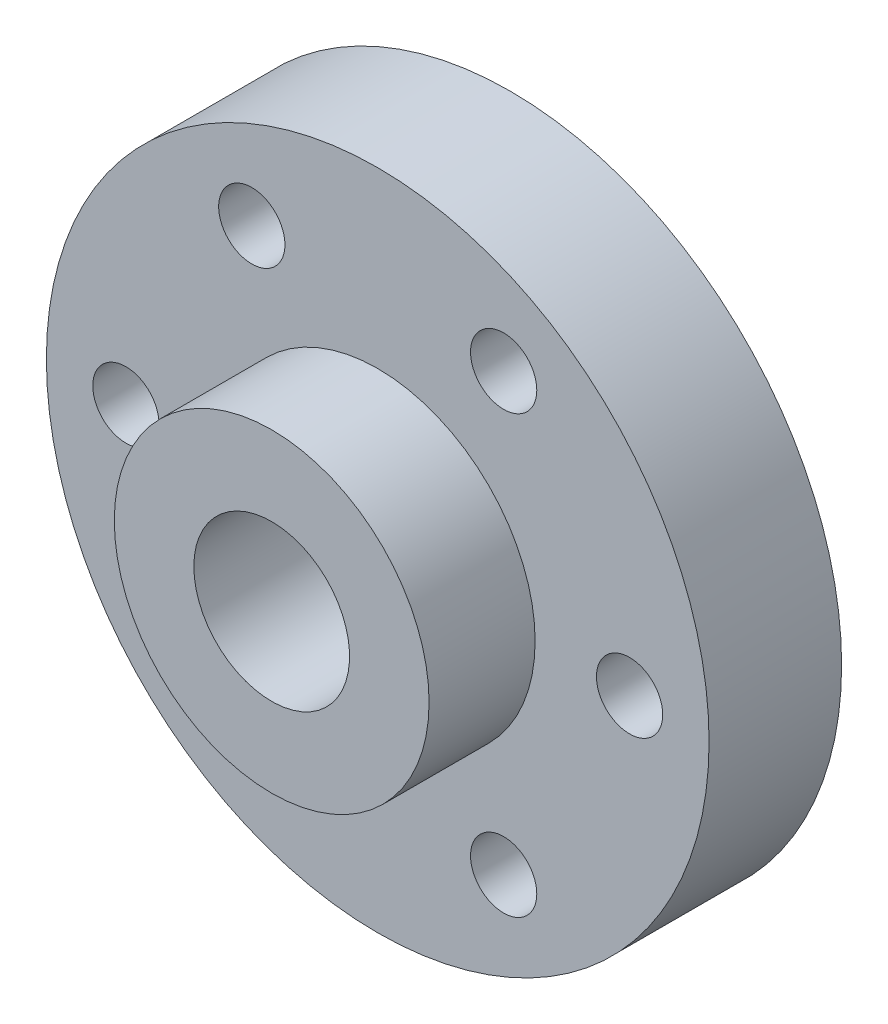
from build123d import *

# Parameters (mm, degrees)
SKETCH1_R           = 12.7
BOSS_EXTRUDE1_DEPTH = 5.08
SKETCH2_R           = 6.0325
BOSS_EXTRUDE2_DEPTH = 4.064
SKETCH3_R           = 2.9845
CUT_EXTRUDE1_DEPTH  = 21.154223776
SKETCH4_R           = 1.27
CUT_EXTRUDE2_DEPTH  = 21.154223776
CIRPATTERN1_COUNT   = 6


with BuildPart() as part:
    # Sketch1 → Boss-Extrude1 (new body)
    with BuildSketch(Plane.XY):
        Circle(SKETCH1_R)
    extrude(amount=BOSS_EXTRUDE1_DEPTH)

    # Sketch2 → Boss-Extrude2 (add)
    with BuildSketch(Plane.XY.offset(5.08)):
        Circle(SKETCH2_R)
    extrude(amount=BOSS_EXTRUDE2_DEPTH)

    # Sketch3 → Cut-Extrude1 (cut, through all)
    with BuildSketch(Plane(origin=(0, 0, 0), x_dir=(-1, 0, 0), z_dir=(0, 0, -1))):
        Circle(SKETCH3_R)
    extrude(amount=-CUT_EXTRUDE1_DEPTH, mode=Mode.SUBTRACT)

    # Sketch4 → Cut-Extrude2 (cut, through all)
    with BuildSketch(Plane(origin=(0, 0, 0), x_dir=(-1, 0, 0), z_dir=(0, 0, -1))):
        with Locations((9.652, 0)):
            Circle(SKETCH4_R)
    cut_extrude2 = extrude(amount=-CUT_EXTRUDE2_DEPTH, mode=Mode.SUBTRACT)

    # CirPattern1: Cut-Extrude2 ×6 about axis
    cirpattern1_axis = Axis((0, 0, 0), (0, 0, 1))
    for i in range(1, CIRPATTERN1_COUNT):
        add(cut_extrude2.rotate(cirpattern1_axis, i * 360 / CIRPATTERN1_COUNT), mode=Mode.SUBTRACT)


solid = part.part
